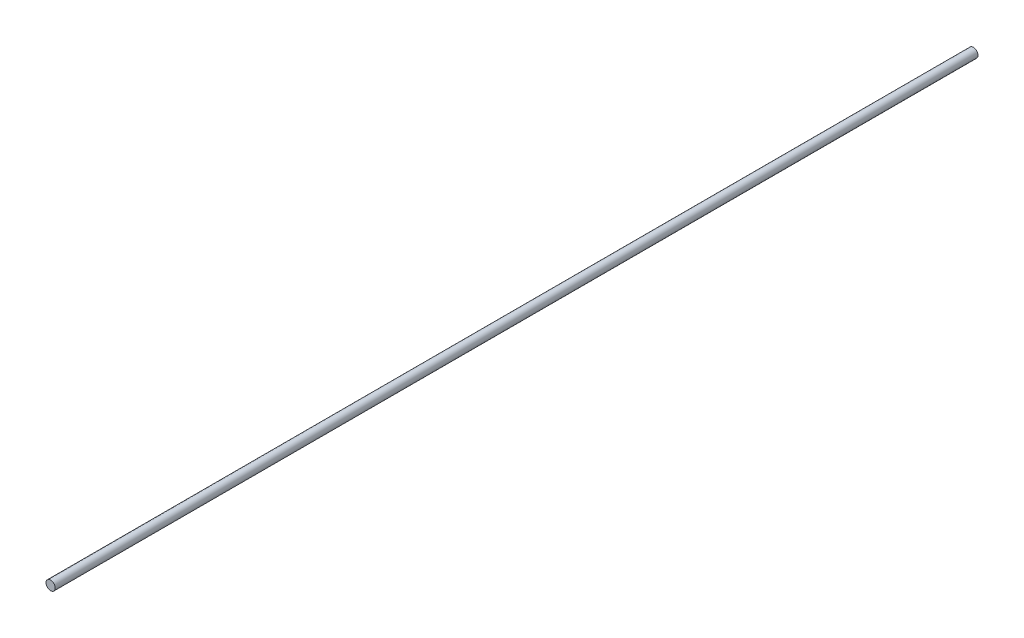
ISO-10303-21;
HEADER;
FILE_DESCRIPTION(('STEP AP214'),'2;1');
FILE_NAME('part.step','',(''),(''),'','','');
FILE_SCHEMA(('AUTOMOTIVE_DESIGN { 1 0 10303 214 1 1 1 1 }'));
ENDSEC;
DATA;
#1=APPLICATION_CONTEXT('core data for automotive mechanical design processes');
#2=APPLICATION_PROTOCOL_DEFINITION('international standard','automotive_design',2000,#1);
#3=PRODUCT_CONTEXT('',#1,'mechanical');
#4=PRODUCT('Part','Part','',(#3));
#5=PRODUCT_RELATED_PRODUCT_CATEGORY('part','',(#4));
#6=PRODUCT_DEFINITION_FORMATION('','',#4);
#7=PRODUCT_DEFINITION_CONTEXT('part definition',#1,'design');
#8=PRODUCT_DEFINITION('design','',#6,#7);
#9=PRODUCT_DEFINITION_SHAPE('','',#8);
#10=(LENGTH_UNIT() NAMED_UNIT(*) SI_UNIT(.MILLI.,.METRE.));
#11=(NAMED_UNIT(*) PLANE_ANGLE_UNIT() SI_UNIT($,.RADIAN.));
#12=(NAMED_UNIT(*) SI_UNIT($,.STERADIAN.) SOLID_ANGLE_UNIT());
#13=UNCERTAINTY_MEASURE_WITH_UNIT(LENGTH_MEASURE(1.E-05),#10,'distance_accuracy_value','');
#14=(GEOMETRIC_REPRESENTATION_CONTEXT(3) GLOBAL_UNCERTAINTY_ASSIGNED_CONTEXT((#13)) GLOBAL_UNIT_ASSIGNED_CONTEXT((#10,
#11,#12)) REPRESENTATION_CONTEXT('',''));
#15=CARTESIAN_POINT('',(0.,0.,0.));
#16=DIRECTION('',(0.,0.,1.));
#17=DIRECTION('',(1.,0.,0.));
#18=AXIS2_PLACEMENT_3D('',#15,#16,#17);
#19=CARTESIAN_POINT('',(0.,0.,-6000.));
#20=DIRECTION('',(0.,0.,1.));
#21=DIRECTION('',(1.,0.,0.));
#22=AXIS2_PLACEMENT_3D('',#19,#20,#21);
#23=CYLINDRICAL_SURFACE('',#22,30.);
#24=CARTESIAN_POINT('',(0.,0.,-6000.));
#25=DIRECTION('',(0.,0.,1.));
#26=DIRECTION('',(1.,0.,0.));
#27=AXIS2_PLACEMENT_3D('',#24,#25,#26);
#28=CIRCLE('',#27,30.);
#29=CARTESIAN_POINT('',(30.,0.,-6000.));
#30=VERTEX_POINT('',#29);
#31=EDGE_CURVE('E10',#30,#30,#28,.T.);
#32=ORIENTED_EDGE('',*,*,#31,.T.);
#33=EDGE_LOOP('',(#32));
#34=FACE_BOUND('',#33,.T.);
#35=CARTESIAN_POINT('',(0.,0.,0.));
#36=DIRECTION('',(0.,0.,1.));
#37=DIRECTION('',(1.,0.,0.));
#38=AXIS2_PLACEMENT_3D('',#35,#36,#37);
#39=CIRCLE('',#38,30.);
#40=CARTESIAN_POINT('',(30.,0.,0.));
#41=VERTEX_POINT('',#40);
#42=EDGE_CURVE('E40',#41,#41,#39,.T.);
#43=ORIENTED_EDGE('',*,*,#42,.F.);
#44=EDGE_LOOP('',(#43));
#45=FACE_BOUND('',#44,.T.);
#46=ADVANCED_FACE('F37',(#34,#45),#23,.T.);
#47=CARTESIAN_POINT('',(0.,0.,-6000.));
#48=DIRECTION('',(0.,0.,1.));
#49=DIRECTION('',(1.,0.,0.));
#50=AXIS2_PLACEMENT_3D('',#47,#48,#49);
#51=PLANE('',#50);
#52=ORIENTED_EDGE('',*,*,#31,.F.);
#53=EDGE_LOOP('',(#52));
#54=FACE_BOUND('',#53,.T.);
#55=ADVANCED_FACE('F54',(#54),#51,.F.);
#56=CARTESIAN_POINT('',(0.,0.,0.));
#57=DIRECTION('',(0.,0.,1.));
#58=DIRECTION('',(1.,0.,0.));
#59=AXIS2_PLACEMENT_3D('',#56,#57,#58);
#60=PLANE('',#59);
#61=ORIENTED_EDGE('',*,*,#42,.T.);
#62=EDGE_LOOP('',(#61));
#63=FACE_BOUND('',#62,.T.);
#64=ADVANCED_FACE('F51',(#63),#60,.T.);
#65=CLOSED_SHELL('',(#46,#55,#64));
#66=MANIFOLD_SOLID_BREP('B2',#65);
#67=ADVANCED_BREP_SHAPE_REPRESENTATION('',(#18,#66),#14);
#68=SHAPE_DEFINITION_REPRESENTATION(#9,#67);
ENDSEC;
END-ISO-10303-21;
